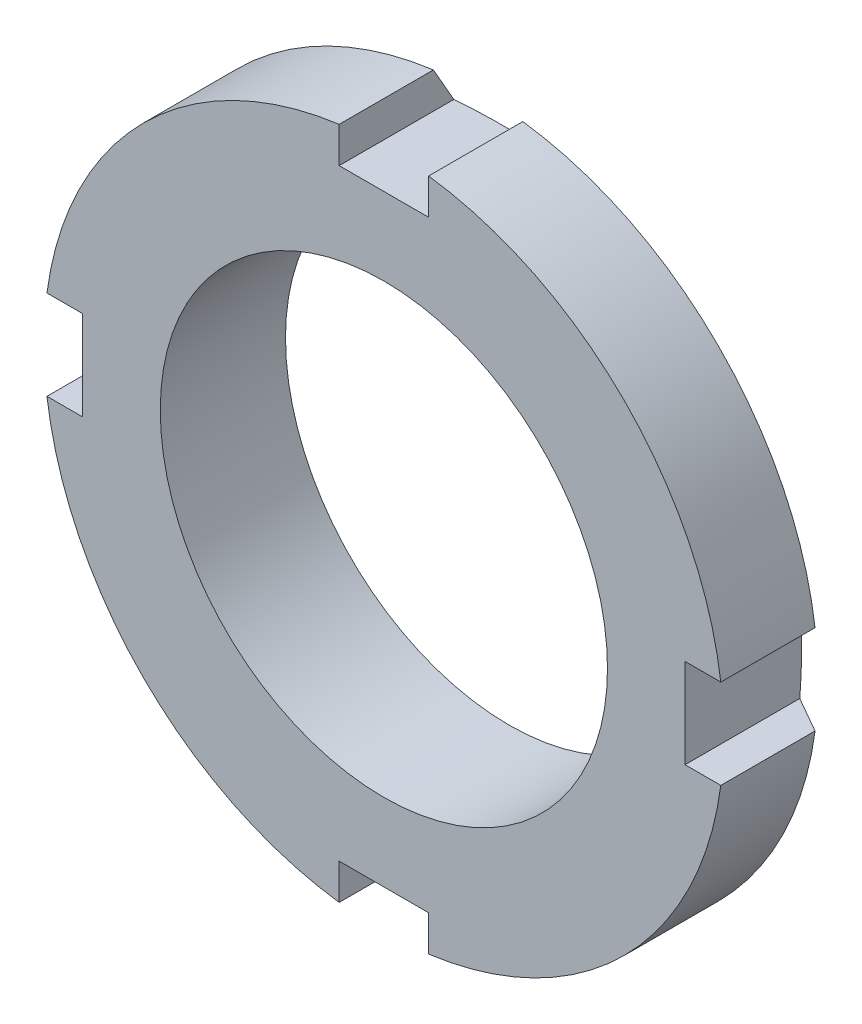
from build123d import *

# Parameters (mm, degrees)
ESQUISSE2_OUTSIDE_W     = 50.838
ESQUISSE2_OUTSIDE_H     = 50.838
ENL_V_MAT_EXTRU_2_DEPTH = 28.766886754


with BuildPart() as part:
    # Esquisse1 → Base-R_volution (revolve)
    with BuildSketch(Plane(origin=(0, 0, 0), x_dir=(0, 0, -1), z_dir=(1, 0, 0)), mode=Mode.PRIVATE) as base_r_volution_sk:
        Polygon((0, 12.5), (0, 16), (-1.732050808, 19), (-7, 19), (-7, 12.5), align=None)
    revolve(base_r_volution_sk.sketch.rotate(Axis((0, 0, 0), (0, 0, 1)), 90), axis=Axis((0, 0, 0), (0, 0, 1)))

    # Esquisse2 outside → Enl_v. mat.-Extru.2 (cut, through all)
    with BuildSketch(Plane.XY):
        Rectangle(ESQUISSE2_OUTSIDE_W, ESQUISSE2_OUTSIDE_H)
        with BuildLine():
            Line((-2.5, 16.834808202), (2.5, 16.834808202))
            Line((2.5, 16.834808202), (2.5, 18.834808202))
            ThreePointArc((2.5, 18.834808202), (13.435028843, 13.435028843), (18.834808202, 2.5))
            Line((18.834808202, 2.5), (16.834808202, 2.5))
            Line((16.834808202, 2.5), (16.834808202, -2.5))
            Line((16.834808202, -2.5), (18.834808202, -2.5))
            ThreePointArc((18.834808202, -2.5), (13.435028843, -13.435028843), (2.5, -18.834808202))
            Line((2.5, -18.834808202), (2.5, -16.834808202))
            Line((2.5, -16.834808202), (-2.5, -16.834808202))
            Line((-2.5, -16.834808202), (-2.5, -18.834808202))
            ThreePointArc((-2.5, -18.834808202), (-13.435028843, -13.435028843), (-18.834808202, -2.5))
            Line((-18.834808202, -2.5), (-16.834808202, -2.5))
            Line((-16.834808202, -2.5), (-16.834808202, 2.5))
            Line((-16.834808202, 2.5), (-18.834808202, 2.5))
            ThreePointArc((-18.834808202, 2.5), (-13.435028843, 13.435028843), (-2.5, 18.834808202))
            Line((-2.5, 18.834808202), (-2.5, 16.834808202))
        make_face(mode=Mode.SUBTRACT)
    extrude(amount=ENL_V_MAT_EXTRU_2_DEPTH, mode=Mode.SUBTRACT)


solid = part.part
